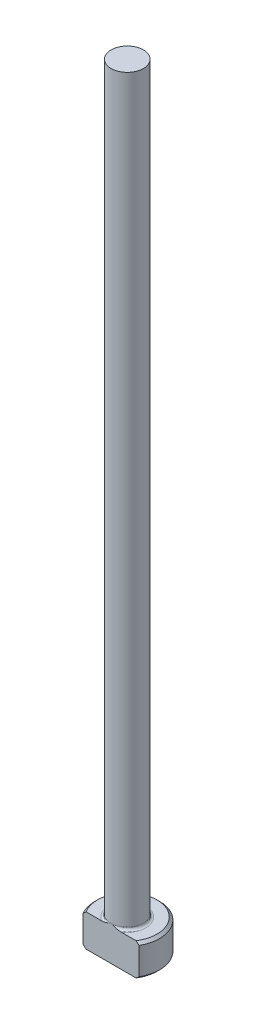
from build123d import *

# Parameters (mm, degrees)
CHAMFER1_SIZE = 0.254
FILLET1_R     = 0.254
KEY_DEPTH     = 77.332177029


with BuildPart() as part:
    # Sketch1 → Revolve1 (revolve)
    with BuildSketch(Plane.XY, mode=Mode.PRIVATE) as revolve1_sk:
        Polygon((0, 0), (-3.175, 0), (-3.175, 3.175), (-1.5875, 3.175), (-1.5875, 76.2), (0, 76.2), align=None)
    revolve(revolve1_sk.sketch.rotate(Axis((0, 259.958771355, 0), (0, -1, 0)), 270), axis=Axis((0, 259.958771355, 0), (0, -1, 0)))

    # Chamfer1
    chamfer1_edges = [part.edges().sort_by_distance(p)[0] for p in [
        (0, 3.175, -3.175),
        (0, 0, -3.175),
    ]]
    chamfer(chamfer1_edges, length=CHAMFER1_SIZE)

    # Fillet1
    fillet1_edges = [part.edges().sort_by_distance(p)[0] for p in [
        (0, 3.175, -1.5875),
    ]]
    fillet(fillet1_edges, radius=FILLET1_R)

    # Sketch2 → KEY (cut, through all)
    with BuildSketch(Plane.XZ):
        with BuildLine():
            Line((-2.749630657, 1.5875), (2.749630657, 1.5875))
            ThreePointArc((2.749630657, 1.5875), (0, 3.175), (-2.749630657, 1.5875))
        make_face()
    extrude(amount=-KEY_DEPTH, mode=Mode.SUBTRACT)


solid = part.part
